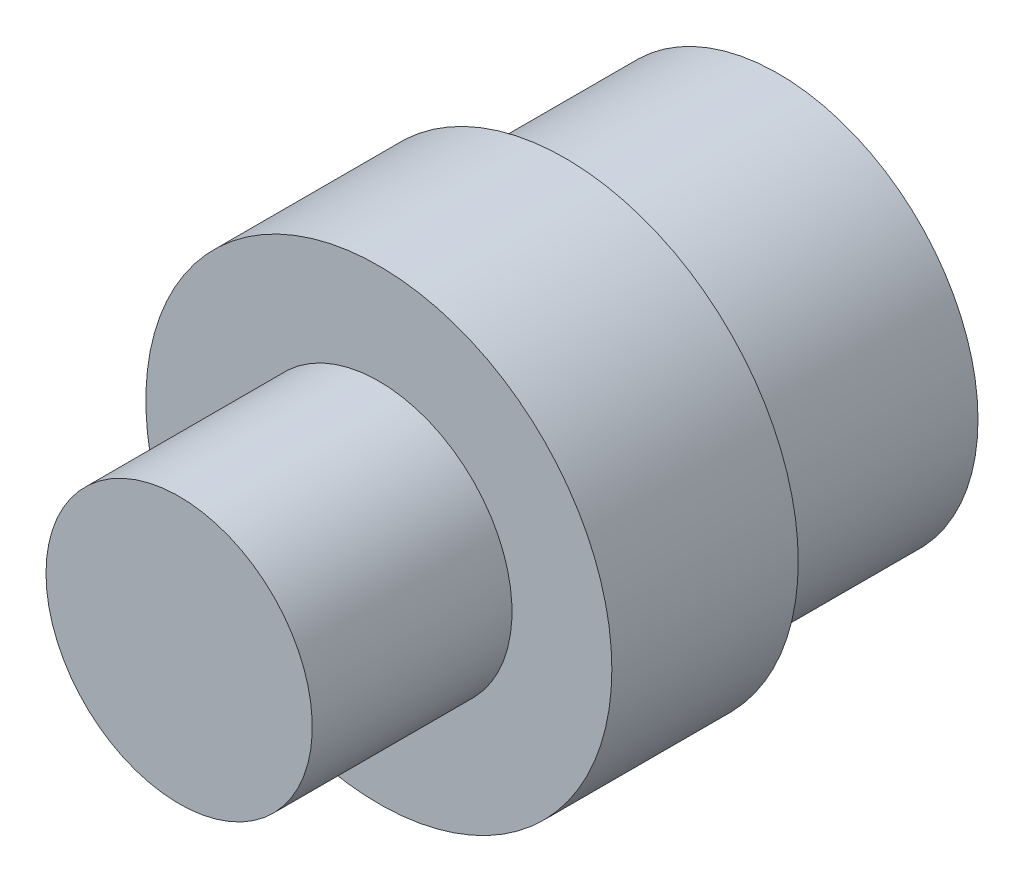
from build123d import *

# Parameters (mm, degrees)
SKETCH1_R      = 6.35
EXTRUDE1_DEPTH = 9.525
SKETCH2_R      = 9.525
EXTRUDE2_DEPTH = 19.05
SKETCH3_R      = 11.1125
EXTRUDE3_DEPTH = 8.89


with BuildPart() as part:
    # Sketch1 → Extrude1 (new body)
    with BuildSketch(Plane.XY):
        with Locations(Location((0, 0, 0), (0, 0, 180))):
            Circle(SKETCH1_R)
    extrude(amount=EXTRUDE1_DEPTH)

    # Sketch2 → Extrude2 (add)
    with BuildSketch(Plane(origin=(0, 0, 0), x_dir=(-1, 0, 0), z_dir=(0, 0, -1))):
        with Locations(Location((0, 0, 0), (0, 0, 180))):
            Circle(SKETCH2_R)
    extrude(amount=EXTRUDE2_DEPTH)

    # Sketch3 → Extrude3 (add)
    with BuildSketch(Plane.XY):
        Circle(SKETCH3_R)
    extrude(amount=-EXTRUDE3_DEPTH)


solid = part.part
